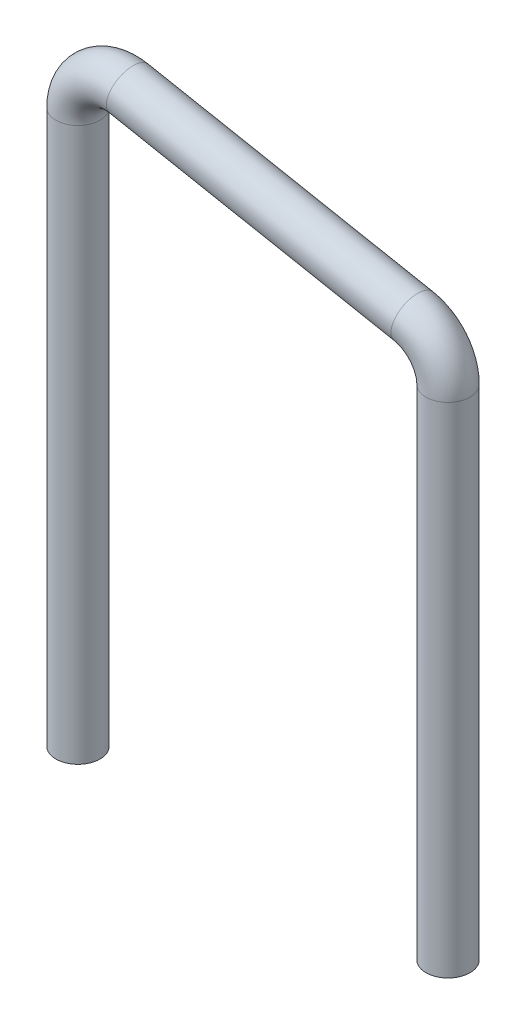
from build123d import *

# Parameters (mm, degrees)
ESQUISSE2_R = 3.1


with BuildPart() as part:
    # Balayage1: sweep along a path in Esquisse1
    with BuildLine(Plane.XY) as balayage1_path:
        Line((0, 0), (0, 70.043906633))
        ThreePointArc((0, 70.043906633), (-1.374067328, 73.864999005), (-4.866915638, 75.935945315))
        Line((-4.866915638, 75.935945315), (-44.866915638, 83.628253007))
        ThreePointArc((-44.866915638, 83.628253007), (-49.821092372, 82.362146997), (-52, 77.736214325))
        Line((-52, 77.736214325), (-52, 0))
    # Esquisse2 → Balayage1 (sweep)
    with BuildSketch(Plane(origin=(0, 0, 0), x_dir=(1, 0, 0), z_dir=(0, 1, 0))):
        Circle(ESQUISSE2_R)
    sweep(path=balayage1_path.line)


solid = part.part
